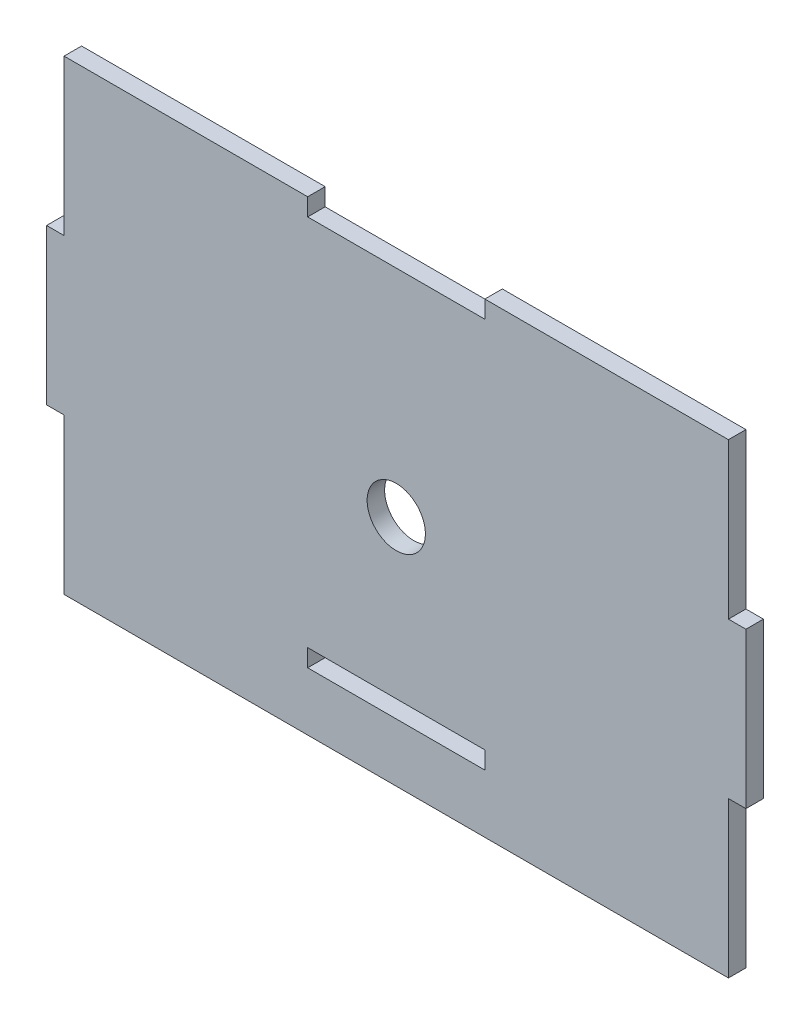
ISO-10303-21;
HEADER;
FILE_DESCRIPTION(('STEP AP214'),'2;1');
FILE_NAME('part.step','',(''),(''),'','','');
FILE_SCHEMA(('AUTOMOTIVE_DESIGN { 1 0 10303 214 1 1 1 1 }'));
ENDSEC;
DATA;
#1=APPLICATION_CONTEXT('core data for automotive mechanical design processes');
#2=APPLICATION_PROTOCOL_DEFINITION('international standard','automotive_design',2000,#1);
#3=PRODUCT_CONTEXT('',#1,'mechanical');
#4=PRODUCT('Part','Part','',(#3));
#5=PRODUCT_RELATED_PRODUCT_CATEGORY('part','',(#4));
#6=PRODUCT_DEFINITION_FORMATION('','',#4);
#7=PRODUCT_DEFINITION_CONTEXT('part definition',#1,'design');
#8=PRODUCT_DEFINITION('design','',#6,#7);
#9=PRODUCT_DEFINITION_SHAPE('','',#8);
#10=(LENGTH_UNIT() NAMED_UNIT(*) SI_UNIT(.MILLI.,.METRE.));
#11=(NAMED_UNIT(*) PLANE_ANGLE_UNIT() SI_UNIT($,.RADIAN.));
#12=(NAMED_UNIT(*) SI_UNIT($,.STERADIAN.) SOLID_ANGLE_UNIT());
#13=UNCERTAINTY_MEASURE_WITH_UNIT(LENGTH_MEASURE(1.E-05),#10,'distance_accuracy_value','');
#14=(GEOMETRIC_REPRESENTATION_CONTEXT(3) GLOBAL_UNCERTAINTY_ASSIGNED_CONTEXT((#13)) GLOBAL_UNIT_ASSIGNED_CONTEXT((#10,
#11,#12)) REPRESENTATION_CONTEXT('',''));
#15=CARTESIAN_POINT('',(0.,0.,0.));
#16=DIRECTION('',(0.,0.,1.));
#17=DIRECTION('',(1.,0.,0.));
#18=AXIS2_PLACEMENT_3D('',#15,#16,#17);
#19=CARTESIAN_POINT('',(0.,0.,3.));
#20=DIRECTION('',(0.,0.,-1.));
#21=DIRECTION('',(-1.,0.,0.));
#22=AXIS2_PLACEMENT_3D('',#19,#20,#21);
#23=PLANE('',#22);
#24=CARTESIAN_POINT('',(0.,0.,3.));
#25=DIRECTION('',(0.,0.,1.));
#26=DIRECTION('',(1.,0.,0.));
#27=AXIS2_PLACEMENT_3D('',#24,#25,#26);
#28=CIRCLE('',#27,5.);
#29=CARTESIAN_POINT('',(5.,0.,3.));
#30=VERTEX_POINT('',#29);
#31=EDGE_CURVE('E640',#30,#30,#28,.T.);
#32=ORIENTED_EDGE('',*,*,#31,.F.);
#33=EDGE_LOOP('',(#32));
#34=FACE_BOUND('',#33,.T.);
#35=DIRECTION('',(0.,-1.,0.));
#36=VECTOR('',#35,1.);
#37=CARTESIAN_POINT('',(15.2,0.,3.));
#38=LINE('',#37,#36);
#39=CARTESIAN_POINT('',(15.2,-27.,3.));
#40=VERTEX_POINT('',#39);
#41=CARTESIAN_POINT('',(15.2,-30.,3.));
#42=VERTEX_POINT('',#41);
#43=EDGE_CURVE('E298',#40,#42,#38,.T.);
#44=ORIENTED_EDGE('',*,*,#43,.T.);
#45=DIRECTION('',(1.,0.,0.));
#46=VECTOR('',#45,1.);
#47=CARTESIAN_POINT('',(0.,-30.,3.));
#48=LINE('',#47,#46);
#49=CARTESIAN_POINT('',(-15.2,-30.,3.));
#50=VERTEX_POINT('',#49);
#51=EDGE_CURVE('E290',#50,#42,#48,.T.);
#52=ORIENTED_EDGE('',*,*,#51,.F.);
#53=DIRECTION('',(0.,-1.,0.));
#54=VECTOR('',#53,1.);
#55=CARTESIAN_POINT('',(-15.2,0.,3.));
#56=LINE('',#55,#54);
#57=CARTESIAN_POINT('',(-15.2,-27.,3.));
#58=VERTEX_POINT('',#57);
#59=EDGE_CURVE('E316',#58,#50,#56,.T.);
#60=ORIENTED_EDGE('',*,*,#59,.F.);
#61=DIRECTION('',(1.,0.,0.));
#62=VECTOR('',#61,1.);
#63=CARTESIAN_POINT('',(0.,-27.,3.));
#64=LINE('',#63,#62);
#65=EDGE_CURVE('E302',#58,#40,#64,.T.);
#66=ORIENTED_EDGE('',*,*,#65,.T.);
#67=EDGE_LOOP('',(#44,#52,#60,#66));
#68=FACE_BOUND('',#67,.T.);
#69=DIRECTION('',(0.,-1.,0.));
#70=VECTOR('',#69,1.);
#71=CARTESIAN_POINT('',(15.2,67.,3.));
#72=LINE('',#71,#70);
#73=CARTESIAN_POINT('',(15.2,40.,3.));
#74=VERTEX_POINT('',#73);
#75=CARTESIAN_POINT('',(15.2,37.,3.));
#76=VERTEX_POINT('',#75);
#77=EDGE_CURVE('E179',#74,#76,#72,.T.);
#78=ORIENTED_EDGE('',*,*,#77,.T.);
#79=DIRECTION('',(1.,0.,0.));
#80=VECTOR('',#79,1.);
#81=CARTESIAN_POINT('',(0.,37.,3.));
#82=LINE('',#81,#80);
#83=CARTESIAN_POINT('',(-15.2,37.,3.));
#84=VERTEX_POINT('',#83);
#85=EDGE_CURVE('E194',#84,#76,#82,.T.);
#86=ORIENTED_EDGE('',*,*,#85,.F.);
#87=DIRECTION('',(0.,-1.,0.));
#88=VECTOR('',#87,1.);
#89=CARTESIAN_POINT('',(-15.2,67.,3.));
#90=LINE('',#89,#88);
#91=CARTESIAN_POINT('',(-15.2,40.,3.));
#92=VERTEX_POINT('',#91);
#93=EDGE_CURVE('E609',#92,#84,#90,.T.);
#94=ORIENTED_EDGE('',*,*,#93,.F.);
#95=DIRECTION('',(-1.,0.,0.));
#96=VECTOR('',#95,1.);
#97=CARTESIAN_POINT('',(-60.,40.,3.));
#98=LINE('',#97,#96);
#99=CARTESIAN_POINT('',(-57.,40.,3.));
#100=VERTEX_POINT('',#99);
#101=EDGE_CURVE('E214',#92,#100,#98,.T.);
#102=ORIENTED_EDGE('',*,*,#101,.T.);
#103=DIRECTION('',(0.,-1.,0.));
#104=VECTOR('',#103,1.);
#105=CARTESIAN_POINT('',(-57.,0.,3.));
#106=LINE('',#105,#104);
#107=CARTESIAN_POINT('',(-57.,13.3333333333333,3.));
#108=VERTEX_POINT('',#107);
#109=EDGE_CURVE('E280',#100,#108,#106,.T.);
#110=ORIENTED_EDGE('',*,*,#109,.T.);
#111=DIRECTION('',(1.,0.,0.));
#112=VECTOR('',#111,1.);
#113=CARTESIAN_POINT('',(0.,13.3333333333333,3.));
#114=LINE('',#113,#112);
#115=CARTESIAN_POINT('',(-60.,13.3333333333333,3.));
#116=VERTEX_POINT('',#115);
#117=EDGE_CURVE('E594',#116,#108,#114,.T.);
#118=ORIENTED_EDGE('',*,*,#117,.F.);
#119=DIRECTION('',(0.,-1.,0.));
#120=VECTOR('',#119,1.);
#121=CARTESIAN_POINT('',(-60.,-40.,3.));
#122=LINE('',#121,#120);
#123=CARTESIAN_POINT('',(-60.,-13.3333333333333,3.));
#124=VERTEX_POINT('',#123);
#125=EDGE_CURVE('E44',#116,#124,#122,.T.);
#126=ORIENTED_EDGE('',*,*,#125,.T.);
#127=DIRECTION('',(1.,0.,0.));
#128=VECTOR('',#127,1.);
#129=CARTESIAN_POINT('',(0.,-13.3333333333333,3.));
#130=LINE('',#129,#128);
#131=CARTESIAN_POINT('',(-57.,-13.3333333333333,3.));
#132=VERTEX_POINT('',#131);
#133=EDGE_CURVE('E271',#124,#132,#130,.T.);
#134=ORIENTED_EDGE('',*,*,#133,.T.);
#135=DIRECTION('',(0.,-1.,0.));
#136=VECTOR('',#135,1.);
#137=CARTESIAN_POINT('',(-57.,0.,3.));
#138=LINE('',#137,#136);
#139=CARTESIAN_POINT('',(-57.,-40.,3.));
#140=VERTEX_POINT('',#139);
#141=EDGE_CURVE('E240',#132,#140,#138,.T.);
#142=ORIENTED_EDGE('',*,*,#141,.T.);
#143=DIRECTION('',(1.,0.,0.));
#144=VECTOR('',#143,1.);
#145=CARTESIAN_POINT('',(-60.,-40.,3.));
#146=LINE('',#145,#144);
#147=CARTESIAN_POINT('',(57.,-40.,3.));
#148=VERTEX_POINT('',#147);
#149=EDGE_CURVE('E12',#140,#148,#146,.T.);
#150=ORIENTED_EDGE('',*,*,#149,.T.);
#151=DIRECTION('',(0.,-1.,0.));
#152=VECTOR('',#151,1.);
#153=CARTESIAN_POINT('',(57.,0.,3.));
#154=LINE('',#153,#152);
#155=CARTESIAN_POINT('',(57.,-13.3333333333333,3.));
#156=VERTEX_POINT('',#155);
#157=EDGE_CURVE('E254',#156,#148,#154,.T.);
#158=ORIENTED_EDGE('',*,*,#157,.F.);
#159=DIRECTION('',(-1.,0.,0.));
#160=VECTOR('',#159,1.);
#161=CARTESIAN_POINT('',(0.,-13.3333333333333,3.));
#162=LINE('',#161,#160);
#163=CARTESIAN_POINT('',(60.,-13.3333333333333,3.));
#164=VERTEX_POINT('',#163);
#165=EDGE_CURVE('E250',#164,#156,#162,.T.);
#166=ORIENTED_EDGE('',*,*,#165,.F.);
#167=DIRECTION('',(0.,1.,0.));
#168=VECTOR('',#167,1.);
#169=CARTESIAN_POINT('',(60.,-40.,3.));
#170=LINE('',#169,#168);
#171=CARTESIAN_POINT('',(60.,13.3333333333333,3.));
#172=VERTEX_POINT('',#171);
#173=EDGE_CURVE('E208',#164,#172,#170,.T.);
#174=ORIENTED_EDGE('',*,*,#173,.T.);
#175=DIRECTION('',(-1.,0.,0.));
#176=VECTOR('',#175,1.);
#177=CARTESIAN_POINT('',(0.,13.3333333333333,3.));
#178=LINE('',#177,#176);
#179=CARTESIAN_POINT('',(57.,13.3333333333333,3.));
#180=VERTEX_POINT('',#179);
#181=EDGE_CURVE('E60',#172,#180,#178,.T.);
#182=ORIENTED_EDGE('',*,*,#181,.T.);
#183=DIRECTION('',(0.,-1.,0.));
#184=VECTOR('',#183,1.);
#185=CARTESIAN_POINT('',(57.,0.,3.));
#186=LINE('',#185,#184);
#187=CARTESIAN_POINT('',(57.,40.,3.));
#188=VERTEX_POINT('',#187);
#189=EDGE_CURVE('E236',#188,#180,#186,.T.);
#190=ORIENTED_EDGE('',*,*,#189,.F.);
#191=EDGE_CURVE('E219',#188,#74,#98,.T.);
#192=ORIENTED_EDGE('',*,*,#191,.T.);
#193=EDGE_LOOP('',(#78,#86,#94,#102,#110,#118,#126,#134,#142,#150,#158,#166,#174,#182,#190,#192));
#194=FACE_BOUND('',#193,.T.);
#195=ADVANCED_FACE('F35',(#34,#68,#194),#23,.F.);
#196=CARTESIAN_POINT('',(0.,0.,0.));
#197=DIRECTION('',(0.,0.,-1.));
#198=DIRECTION('',(-1.,0.,0.));
#199=AXIS2_PLACEMENT_3D('',#196,#197,#198);
#200=PLANE('',#199);
#201=CARTESIAN_POINT('',(0.,0.,0.));
#202=DIRECTION('',(0.,0.,-1.));
#203=DIRECTION('',(-1.,0.,0.));
#204=AXIS2_PLACEMENT_3D('',#201,#202,#203);
#205=CIRCLE('',#204,5.);
#206=CARTESIAN_POINT('',(-5.,0.,0.));
#207=VERTEX_POINT('',#206);
#208=EDGE_CURVE('E39',#207,#207,#205,.T.);
#209=ORIENTED_EDGE('',*,*,#208,.F.);
#210=EDGE_LOOP('',(#209));
#211=FACE_BOUND('',#210,.T.);
#212=DIRECTION('',(1.,0.,0.));
#213=VECTOR('',#212,1.);
#214=CARTESIAN_POINT('',(0.,-30.,0.));
#215=LINE('',#214,#213);
#216=CARTESIAN_POINT('',(-15.2,-30.,0.));
#217=VERTEX_POINT('',#216);
#218=CARTESIAN_POINT('',(15.2,-30.,0.));
#219=VERTEX_POINT('',#218);
#220=EDGE_CURVE('E295',#217,#219,#215,.T.);
#221=ORIENTED_EDGE('',*,*,#220,.T.);
#222=DIRECTION('',(0.,-1.,0.));
#223=VECTOR('',#222,1.);
#224=CARTESIAN_POINT('',(15.2,0.,0.));
#225=LINE('',#224,#223);
#226=CARTESIAN_POINT('',(15.2,-27.,0.));
#227=VERTEX_POINT('',#226);
#228=EDGE_CURVE('E287',#227,#219,#225,.T.);
#229=ORIENTED_EDGE('',*,*,#228,.F.);
#230=DIRECTION('',(1.,0.,0.));
#231=VECTOR('',#230,1.);
#232=CARTESIAN_POINT('',(0.,-27.,0.));
#233=LINE('',#232,#231);
#234=CARTESIAN_POINT('',(-15.2,-27.,0.));
#235=VERTEX_POINT('',#234);
#236=EDGE_CURVE('E289',#235,#227,#233,.T.);
#237=ORIENTED_EDGE('',*,*,#236,.F.);
#238=DIRECTION('',(0.,-1.,0.));
#239=VECTOR('',#238,1.);
#240=CARTESIAN_POINT('',(-15.2,0.,0.));
#241=LINE('',#240,#239);
#242=EDGE_CURVE('E292',#235,#217,#241,.T.);
#243=ORIENTED_EDGE('',*,*,#242,.T.);
#244=EDGE_LOOP('',(#221,#229,#237,#243));
#245=FACE_BOUND('',#244,.T.);
#246=DIRECTION('',(1.,0.,0.));
#247=VECTOR('',#246,1.);
#248=CARTESIAN_POINT('',(0.,37.,0.));
#249=LINE('',#248,#247);
#250=CARTESIAN_POINT('',(-15.2,37.,0.));
#251=VERTEX_POINT('',#250);
#252=CARTESIAN_POINT('',(15.2,37.,0.));
#253=VERTEX_POINT('',#252);
#254=EDGE_CURVE('E185',#251,#253,#249,.T.);
#255=ORIENTED_EDGE('',*,*,#254,.T.);
#256=DIRECTION('',(0.,-1.,0.));
#257=VECTOR('',#256,1.);
#258=CARTESIAN_POINT('',(15.2,67.,0.));
#259=LINE('',#258,#257);
#260=CARTESIAN_POINT('',(15.2,40.,0.));
#261=VERTEX_POINT('',#260);
#262=EDGE_CURVE('E176',#261,#253,#259,.T.);
#263=ORIENTED_EDGE('',*,*,#262,.F.);
#264=DIRECTION('',(-1.,0.,0.));
#265=VECTOR('',#264,1.);
#266=CARTESIAN_POINT('',(-60.,40.,0.));
#267=LINE('',#266,#265);
#268=CARTESIAN_POINT('',(57.,40.,0.));
#269=VERTEX_POINT('',#268);
#270=EDGE_CURVE('E192',#269,#261,#267,.T.);
#271=ORIENTED_EDGE('',*,*,#270,.F.);
#272=DIRECTION('',(0.,-1.,0.));
#273=VECTOR('',#272,1.);
#274=CARTESIAN_POINT('',(57.,0.,0.));
#275=LINE('',#274,#273);
#276=CARTESIAN_POINT('',(57.,13.3333333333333,0.));
#277=VERTEX_POINT('',#276);
#278=EDGE_CURVE('E235',#269,#277,#275,.T.);
#279=ORIENTED_EDGE('',*,*,#278,.T.);
#280=DIRECTION('',(-1.,0.,0.));
#281=VECTOR('',#280,1.);
#282=CARTESIAN_POINT('',(0.,13.3333333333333,0.));
#283=LINE('',#282,#281);
#284=CARTESIAN_POINT('',(60.,13.3333333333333,0.));
#285=VERTEX_POINT('',#284);
#286=EDGE_CURVE('E245',#285,#277,#283,.T.);
#287=ORIENTED_EDGE('',*,*,#286,.F.);
#288=DIRECTION('',(0.,1.,0.));
#289=VECTOR('',#288,1.);
#290=CARTESIAN_POINT('',(60.,-40.,0.));
#291=LINE('',#290,#289);
#292=CARTESIAN_POINT('',(60.,-13.3333333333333,0.));
#293=VERTEX_POINT('',#292);
#294=EDGE_CURVE('E205',#293,#285,#291,.T.);
#295=ORIENTED_EDGE('',*,*,#294,.F.);
#296=DIRECTION('',(-1.,0.,0.));
#297=VECTOR('',#296,1.);
#298=CARTESIAN_POINT('',(0.,-13.3333333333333,0.));
#299=LINE('',#298,#297);
#300=CARTESIAN_POINT('',(57.,-13.3333333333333,0.));
#301=VERTEX_POINT('',#300);
#302=EDGE_CURVE('E249',#293,#301,#299,.T.);
#303=ORIENTED_EDGE('',*,*,#302,.T.);
#304=DIRECTION('',(0.,-1.,0.));
#305=VECTOR('',#304,1.);
#306=CARTESIAN_POINT('',(57.,0.,0.));
#307=LINE('',#306,#305);
#308=CARTESIAN_POINT('',(57.,-40.,0.));
#309=VERTEX_POINT('',#308);
#310=EDGE_CURVE('E246',#301,#309,#307,.T.);
#311=ORIENTED_EDGE('',*,*,#310,.T.);
#312=DIRECTION('',(1.,0.,0.));
#313=VECTOR('',#312,1.);
#314=CARTESIAN_POINT('',(-60.,-40.,0.));
#315=LINE('',#314,#313);
#316=CARTESIAN_POINT('',(-57.,-40.,0.));
#317=VERTEX_POINT('',#316);
#318=EDGE_CURVE('E203',#317,#309,#315,.T.);
#319=ORIENTED_EDGE('',*,*,#318,.F.);
#320=DIRECTION('',(0.,-1.,0.));
#321=VECTOR('',#320,1.);
#322=CARTESIAN_POINT('',(-57.,0.,0.));
#323=LINE('',#322,#321);
#324=CARTESIAN_POINT('',(-57.,-13.3333333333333,0.));
#325=VERTEX_POINT('',#324);
#326=EDGE_CURVE('E275',#325,#317,#323,.T.);
#327=ORIENTED_EDGE('',*,*,#326,.F.);
#328=DIRECTION('',(1.,0.,0.));
#329=VECTOR('',#328,1.);
#330=CARTESIAN_POINT('',(0.,-13.3333333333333,0.));
#331=LINE('',#330,#329);
#332=CARTESIAN_POINT('',(-60.,-13.3333333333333,0.));
#333=VERTEX_POINT('',#332);
#334=EDGE_CURVE('E286',#333,#325,#331,.T.);
#335=ORIENTED_EDGE('',*,*,#334,.F.);
#336=DIRECTION('',(0.,-1.,0.));
#337=VECTOR('',#336,1.);
#338=CARTESIAN_POINT('',(-60.,-40.,0.));
#339=LINE('',#338,#337);
#340=CARTESIAN_POINT('',(-60.,13.3333333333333,0.));
#341=VERTEX_POINT('',#340);
#342=EDGE_CURVE('E199',#341,#333,#339,.T.);
#343=ORIENTED_EDGE('',*,*,#342,.F.);
#344=DIRECTION('',(1.,0.,0.));
#345=VECTOR('',#344,1.);
#346=CARTESIAN_POINT('',(0.,13.3333333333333,0.));
#347=LINE('',#346,#345);
#348=CARTESIAN_POINT('',(-57.,13.3333333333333,0.));
#349=VERTEX_POINT('',#348);
#350=EDGE_CURVE('E587',#341,#349,#347,.T.);
#351=ORIENTED_EDGE('',*,*,#350,.T.);
#352=DIRECTION('',(0.,-1.,0.));
#353=VECTOR('',#352,1.);
#354=CARTESIAN_POINT('',(-57.,0.,0.));
#355=LINE('',#354,#353);
#356=CARTESIAN_POINT('',(-57.,40.,0.));
#357=VERTEX_POINT('',#356);
#358=EDGE_CURVE('E598',#357,#349,#355,.T.);
#359=ORIENTED_EDGE('',*,*,#358,.F.);
#360=CARTESIAN_POINT('',(-15.2,40.,0.));
#361=VERTEX_POINT('',#360);
#362=EDGE_CURVE('E200',#361,#357,#267,.T.);
#363=ORIENTED_EDGE('',*,*,#362,.F.);
#364=DIRECTION('',(0.,-1.,0.));
#365=VECTOR('',#364,1.);
#366=CARTESIAN_POINT('',(-15.2,67.,0.));
#367=LINE('',#366,#365);
#368=EDGE_CURVE('E52',#361,#251,#367,.T.);
#369=ORIENTED_EDGE('',*,*,#368,.T.);
#370=EDGE_LOOP('',(#255,#263,#271,#279,#287,#295,#303,#311,#319,#327,#335,#343,#351,#359,#363,#369));
#371=FACE_BOUND('',#370,.T.);
#372=ADVANCED_FACE('F190',(#211,#245,#371),#200,.T.);
#373=CARTESIAN_POINT('',(-60.,40.,3.));
#374=DIRECTION('',(0.,-1.,0.));
#375=DIRECTION('',(0.,0.,-1.));
#376=AXIS2_PLACEMENT_3D('',#373,#374,#375);
#377=PLANE('',#376);
#378=DIRECTION('',(0.,0.,1.));
#379=VECTOR('',#378,1.);
#380=CARTESIAN_POINT('',(15.2,40.,0.));
#381=LINE('',#380,#379);
#382=EDGE_CURVE('E173',#261,#74,#381,.T.);
#383=ORIENTED_EDGE('',*,*,#382,.T.);
#384=ORIENTED_EDGE('',*,*,#191,.F.);
#385=DIRECTION('',(0.,0.,1.));
#386=VECTOR('',#385,1.);
#387=CARTESIAN_POINT('',(57.,40.,0.));
#388=LINE('',#387,#386);
#389=EDGE_CURVE('E198',#269,#188,#388,.T.);
#390=ORIENTED_EDGE('',*,*,#389,.F.);
#391=ORIENTED_EDGE('',*,*,#270,.T.);
#392=EDGE_LOOP('',(#383,#384,#390,#391));
#393=FACE_BOUND('',#392,.T.);
#394=ADVANCED_FACE('F197',(#393),#377,.F.);
#395=CARTESIAN_POINT('',(60.,-40.,3.));
#396=DIRECTION('',(-1.,0.,0.));
#397=DIRECTION('',(0.,0.,1.));
#398=AXIS2_PLACEMENT_3D('',#395,#396,#397);
#399=PLANE('',#398);
#400=DIRECTION('',(0.,0.,1.));
#401=VECTOR('',#400,1.);
#402=CARTESIAN_POINT('',(60.,13.3333333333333,0.));
#403=LINE('',#402,#401);
#404=EDGE_CURVE('E241',#285,#172,#403,.T.);
#405=ORIENTED_EDGE('',*,*,#404,.T.);
#406=ORIENTED_EDGE('',*,*,#173,.F.);
#407=DIRECTION('',(0.,0.,1.));
#408=VECTOR('',#407,1.);
#409=CARTESIAN_POINT('',(60.,-13.3333333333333,0.));
#410=LINE('',#409,#408);
#411=EDGE_CURVE('E629',#293,#164,#410,.T.);
#412=ORIENTED_EDGE('',*,*,#411,.F.);
#413=ORIENTED_EDGE('',*,*,#294,.T.);
#414=EDGE_LOOP('',(#405,#406,#412,#413));
#415=FACE_BOUND('',#414,.T.);
#416=ADVANCED_FACE('F37',(#415),#399,.F.);
#417=ORIENTED_EDGE('',*,*,#101,.F.);
#418=DIRECTION('',(0.,0.,1.));
#419=VECTOR('',#418,1.);
#420=CARTESIAN_POINT('',(-15.2,40.,0.));
#421=LINE('',#420,#419);
#422=EDGE_CURVE('E184',#361,#92,#421,.T.);
#423=ORIENTED_EDGE('',*,*,#422,.F.);
#424=ORIENTED_EDGE('',*,*,#362,.T.);
#425=DIRECTION('',(0.,0.,1.));
#426=VECTOR('',#425,1.);
#427=CARTESIAN_POINT('',(-57.,40.,0.));
#428=LINE('',#427,#426);
#429=EDGE_CURVE('E590',#357,#100,#428,.T.);
#430=ORIENTED_EDGE('',*,*,#429,.T.);
#431=EDGE_LOOP('',(#417,#423,#424,#430));
#432=FACE_BOUND('',#431,.T.);
#433=ADVANCED_FACE('F366',(#432),#377,.F.);
#434=CARTESIAN_POINT('',(-60.,-40.,3.));
#435=DIRECTION('',(1.,0.,0.));
#436=DIRECTION('',(0.,0.,-1.));
#437=AXIS2_PLACEMENT_3D('',#434,#435,#436);
#438=PLANE('',#437);
#439=ORIENTED_EDGE('',*,*,#125,.F.);
#440=DIRECTION('',(0.,0.,1.));
#441=VECTOR('',#440,1.);
#442=CARTESIAN_POINT('',(-60.,13.3333333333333,0.));
#443=LINE('',#442,#441);
#444=EDGE_CURVE('E584',#341,#116,#443,.T.);
#445=ORIENTED_EDGE('',*,*,#444,.F.);
#446=ORIENTED_EDGE('',*,*,#342,.T.);
#447=DIRECTION('',(0.,0.,1.));
#448=VECTOR('',#447,1.);
#449=CARTESIAN_POINT('',(-60.,-13.3333333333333,0.));
#450=LINE('',#449,#448);
#451=EDGE_CURVE('E281',#333,#124,#450,.T.);
#452=ORIENTED_EDGE('',*,*,#451,.T.);
#453=EDGE_LOOP('',(#439,#445,#446,#452));
#454=FACE_BOUND('',#453,.T.);
#455=ADVANCED_FACE('F352',(#454),#438,.F.);
#456=CARTESIAN_POINT('',(-60.,-40.,3.));
#457=DIRECTION('',(0.,1.,0.));
#458=DIRECTION('',(0.,0.,1.));
#459=AXIS2_PLACEMENT_3D('',#456,#457,#458);
#460=PLANE('',#459);
#461=ORIENTED_EDGE('',*,*,#318,.T.);
#462=DIRECTION('',(0.,0.,1.));
#463=VECTOR('',#462,1.);
#464=CARTESIAN_POINT('',(57.,-40.,0.));
#465=LINE('',#464,#463);
#466=EDGE_CURVE('E253',#309,#148,#465,.T.);
#467=ORIENTED_EDGE('',*,*,#466,.T.);
#468=ORIENTED_EDGE('',*,*,#149,.F.);
#469=DIRECTION('',(0.,0.,1.));
#470=VECTOR('',#469,1.);
#471=CARTESIAN_POINT('',(-57.,-40.,0.));
#472=LINE('',#471,#470);
#473=EDGE_CURVE('E278',#317,#140,#472,.T.);
#474=ORIENTED_EDGE('',*,*,#473,.F.);
#475=EDGE_LOOP('',(#461,#467,#468,#474));
#476=FACE_BOUND('',#475,.T.);
#477=ADVANCED_FACE('F345',(#476),#460,.F.);
#478=CARTESIAN_POINT('',(15.2,0.,0.));
#479=DIRECTION('',(-1.,0.,0.));
#480=DIRECTION('',(0.,-1.,0.));
#481=AXIS2_PLACEMENT_3D('',#478,#479,#480);
#482=PLANE('',#481);
#483=ORIENTED_EDGE('',*,*,#43,.F.);
#484=DIRECTION('',(0.,0.,1.));
#485=VECTOR('',#484,1.);
#486=CARTESIAN_POINT('',(15.2,-27.,0.));
#487=LINE('',#486,#485);
#488=EDGE_CURVE('E222',#227,#40,#487,.T.);
#489=ORIENTED_EDGE('',*,*,#488,.F.);
#490=ORIENTED_EDGE('',*,*,#228,.T.);
#491=DIRECTION('',(0.,0.,1.));
#492=VECTOR('',#491,1.);
#493=CARTESIAN_POINT('',(15.2,-30.,0.));
#494=LINE('',#493,#492);
#495=EDGE_CURVE('E318',#219,#42,#494,.T.);
#496=ORIENTED_EDGE('',*,*,#495,.T.);
#497=EDGE_LOOP('',(#483,#489,#490,#496));
#498=FACE_BOUND('',#497,.T.);
#499=ADVANCED_FACE('F343',(#498),#482,.T.);
#500=CARTESIAN_POINT('',(0.,-30.,0.));
#501=DIRECTION('',(0.,-1.,0.));
#502=DIRECTION('',(1.,0.,0.));
#503=AXIS2_PLACEMENT_3D('',#500,#501,#502);
#504=PLANE('',#503);
#505=ORIENTED_EDGE('',*,*,#51,.T.);
#506=ORIENTED_EDGE('',*,*,#495,.F.);
#507=ORIENTED_EDGE('',*,*,#220,.F.);
#508=DIRECTION('',(0.,0.,1.));
#509=VECTOR('',#508,1.);
#510=CARTESIAN_POINT('',(-15.2,-30.,0.));
#511=LINE('',#510,#509);
#512=EDGE_CURVE('E320',#217,#50,#511,.T.);
#513=ORIENTED_EDGE('',*,*,#512,.T.);
#514=EDGE_LOOP('',(#505,#506,#507,#513));
#515=FACE_BOUND('',#514,.T.);
#516=ADVANCED_FACE('F341',(#515),#504,.F.);
#517=CARTESIAN_POINT('',(-15.2,0.,0.));
#518=DIRECTION('',(-1.,0.,0.));
#519=DIRECTION('',(0.,-1.,0.));
#520=AXIS2_PLACEMENT_3D('',#517,#518,#519);
#521=PLANE('',#520);
#522=ORIENTED_EDGE('',*,*,#59,.T.);
#523=ORIENTED_EDGE('',*,*,#512,.F.);
#524=ORIENTED_EDGE('',*,*,#242,.F.);
#525=DIRECTION('',(0.,0.,1.));
#526=VECTOR('',#525,1.);
#527=CARTESIAN_POINT('',(-15.2,-27.,0.));
#528=LINE('',#527,#526);
#529=EDGE_CURVE('E321',#235,#58,#528,.T.);
#530=ORIENTED_EDGE('',*,*,#529,.T.);
#531=EDGE_LOOP('',(#522,#523,#524,#530));
#532=FACE_BOUND('',#531,.T.);
#533=ADVANCED_FACE('F337',(#532),#521,.F.);
#534=CARTESIAN_POINT('',(0.,-27.,0.));
#535=DIRECTION('',(0.,-1.,0.));
#536=DIRECTION('',(0.,0.,-1.));
#537=AXIS2_PLACEMENT_3D('',#534,#535,#536);
#538=PLANE('',#537);
#539=ORIENTED_EDGE('',*,*,#65,.F.);
#540=ORIENTED_EDGE('',*,*,#529,.F.);
#541=ORIENTED_EDGE('',*,*,#236,.T.);
#542=ORIENTED_EDGE('',*,*,#488,.T.);
#543=EDGE_LOOP('',(#539,#540,#541,#542));
#544=FACE_BOUND('',#543,.T.);
#545=ADVANCED_FACE('F330',(#544),#538,.T.);
#546=CARTESIAN_POINT('',(-57.,0.,0.));
#547=DIRECTION('',(-1.,0.,0.));
#548=DIRECTION('',(0.,0.,1.));
#549=AXIS2_PLACEMENT_3D('',#546,#547,#548);
#550=PLANE('',#549);
#551=ORIENTED_EDGE('',*,*,#141,.F.);
#552=DIRECTION('',(0.,0.,1.));
#553=VECTOR('',#552,1.);
#554=CARTESIAN_POINT('',(-57.,-13.3333333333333,0.));
#555=LINE('',#554,#553);
#556=EDGE_CURVE('E284',#325,#132,#555,.T.);
#557=ORIENTED_EDGE('',*,*,#556,.F.);
#558=ORIENTED_EDGE('',*,*,#326,.T.);
#559=ORIENTED_EDGE('',*,*,#473,.T.);
#560=EDGE_LOOP('',(#551,#557,#558,#559));
#561=FACE_BOUND('',#560,.T.);
#562=ADVANCED_FACE('F505',(#561),#550,.T.);
#563=CARTESIAN_POINT('',(0.,-13.3333333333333,0.));
#564=DIRECTION('',(0.,-1.,0.));
#565=DIRECTION('',(0.,0.,-1.));
#566=AXIS2_PLACEMENT_3D('',#563,#564,#565);
#567=PLANE('',#566);
#568=ORIENTED_EDGE('',*,*,#133,.F.);
#569=ORIENTED_EDGE('',*,*,#451,.F.);
#570=ORIENTED_EDGE('',*,*,#334,.T.);
#571=ORIENTED_EDGE('',*,*,#556,.T.);
#572=EDGE_LOOP('',(#568,#569,#570,#571));
#573=FACE_BOUND('',#572,.T.);
#574=ADVANCED_FACE('F501',(#573),#567,.T.);
#575=CARTESIAN_POINT('',(-57.,0.,0.));
#576=DIRECTION('',(-1.,0.,0.));
#577=DIRECTION('',(0.,0.,1.));
#578=AXIS2_PLACEMENT_3D('',#575,#576,#577);
#579=PLANE('',#578);
#580=ORIENTED_EDGE('',*,*,#109,.F.);
#581=ORIENTED_EDGE('',*,*,#429,.F.);
#582=ORIENTED_EDGE('',*,*,#358,.T.);
#583=DIRECTION('',(0.,0.,1.));
#584=VECTOR('',#583,1.);
#585=CARTESIAN_POINT('',(-57.,13.3333333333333,0.));
#586=LINE('',#585,#584);
#587=EDGE_CURVE('E303',#349,#108,#586,.T.);
#588=ORIENTED_EDGE('',*,*,#587,.T.);
#589=EDGE_LOOP('',(#580,#581,#582,#588));
#590=FACE_BOUND('',#589,.T.);
#591=ADVANCED_FACE('F497',(#590),#579,.T.);
#592=CARTESIAN_POINT('',(0.,13.3333333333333,0.));
#593=DIRECTION('',(0.,-1.,0.));
#594=DIRECTION('',(0.,0.,-1.));
#595=AXIS2_PLACEMENT_3D('',#592,#593,#594);
#596=PLANE('',#595);
#597=ORIENTED_EDGE('',*,*,#117,.T.);
#598=ORIENTED_EDGE('',*,*,#587,.F.);
#599=ORIENTED_EDGE('',*,*,#350,.F.);
#600=ORIENTED_EDGE('',*,*,#444,.T.);
#601=EDGE_LOOP('',(#597,#598,#599,#600));
#602=FACE_BOUND('',#601,.T.);
#603=ADVANCED_FACE('F393',(#602),#596,.F.);
#604=CARTESIAN_POINT('',(57.,0.,0.));
#605=DIRECTION('',(-1.,0.,0.));
#606=DIRECTION('',(0.,0.,1.));
#607=AXIS2_PLACEMENT_3D('',#604,#605,#606);
#608=PLANE('',#607);
#609=ORIENTED_EDGE('',*,*,#157,.T.);
#610=ORIENTED_EDGE('',*,*,#466,.F.);
#611=ORIENTED_EDGE('',*,*,#310,.F.);
#612=DIRECTION('',(0.,0.,1.));
#613=VECTOR('',#612,1.);
#614=CARTESIAN_POINT('',(57.,-13.3333333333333,0.));
#615=LINE('',#614,#613);
#616=EDGE_CURVE('E628',#301,#156,#615,.T.);
#617=ORIENTED_EDGE('',*,*,#616,.T.);
#618=EDGE_LOOP('',(#609,#610,#611,#617));
#619=FACE_BOUND('',#618,.T.);
#620=ADVANCED_FACE('F405',(#619),#608,.F.);
#621=CARTESIAN_POINT('',(0.,-13.3333333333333,0.));
#622=DIRECTION('',(0.,1.,0.));
#623=DIRECTION('',(0.,0.,1.));
#624=AXIS2_PLACEMENT_3D('',#621,#622,#623);
#625=PLANE('',#624);
#626=ORIENTED_EDGE('',*,*,#165,.T.);
#627=ORIENTED_EDGE('',*,*,#616,.F.);
#628=ORIENTED_EDGE('',*,*,#302,.F.);
#629=ORIENTED_EDGE('',*,*,#411,.T.);
#630=EDGE_LOOP('',(#626,#627,#628,#629));
#631=FACE_BOUND('',#630,.T.);
#632=ADVANCED_FACE('F409',(#631),#625,.F.);
#633=CARTESIAN_POINT('',(57.,0.,0.));
#634=DIRECTION('',(-1.,0.,0.));
#635=DIRECTION('',(0.,0.,1.));
#636=AXIS2_PLACEMENT_3D('',#633,#634,#635);
#637=PLANE('',#636);
#638=ORIENTED_EDGE('',*,*,#189,.T.);
#639=DIRECTION('',(0.,0.,1.));
#640=VECTOR('',#639,1.);
#641=CARTESIAN_POINT('',(57.,13.3333333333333,0.));
#642=LINE('',#641,#640);
#643=EDGE_CURVE('E243',#277,#180,#642,.T.);
#644=ORIENTED_EDGE('',*,*,#643,.F.);
#645=ORIENTED_EDGE('',*,*,#278,.F.);
#646=ORIENTED_EDGE('',*,*,#389,.T.);
#647=EDGE_LOOP('',(#638,#644,#645,#646));
#648=FACE_BOUND('',#647,.T.);
#649=ADVANCED_FACE('F420',(#648),#637,.F.);
#650=CARTESIAN_POINT('',(0.,13.3333333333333,0.));
#651=DIRECTION('',(0.,1.,0.));
#652=DIRECTION('',(0.,0.,1.));
#653=AXIS2_PLACEMENT_3D('',#650,#651,#652);
#654=PLANE('',#653);
#655=ORIENTED_EDGE('',*,*,#181,.F.);
#656=ORIENTED_EDGE('',*,*,#404,.F.);
#657=ORIENTED_EDGE('',*,*,#286,.T.);
#658=ORIENTED_EDGE('',*,*,#643,.T.);
#659=EDGE_LOOP('',(#655,#656,#657,#658));
#660=FACE_BOUND('',#659,.T.);
#661=ADVANCED_FACE('F429',(#660),#654,.T.);
#662=CARTESIAN_POINT('',(15.2,67.,0.));
#663=DIRECTION('',(-1.,0.,0.));
#664=DIRECTION('',(0.,-1.,0.));
#665=AXIS2_PLACEMENT_3D('',#662,#663,#664);
#666=PLANE('',#665);
#667=ORIENTED_EDGE('',*,*,#77,.F.);
#668=ORIENTED_EDGE('',*,*,#382,.F.);
#669=ORIENTED_EDGE('',*,*,#262,.T.);
#670=DIRECTION('',(0.,0.,1.));
#671=VECTOR('',#670,1.);
#672=CARTESIAN_POINT('',(15.2,37.,0.));
#673=LINE('',#672,#671);
#674=EDGE_CURVE('E256',#253,#76,#673,.T.);
#675=ORIENTED_EDGE('',*,*,#674,.T.);
#676=EDGE_LOOP('',(#667,#668,#669,#675));
#677=FACE_BOUND('',#676,.T.);
#678=ADVANCED_FACE('F175',(#677),#666,.T.);
#679=CARTESIAN_POINT('',(0.,37.,0.));
#680=DIRECTION('',(0.,-1.,0.));
#681=DIRECTION('',(1.,0.,0.));
#682=AXIS2_PLACEMENT_3D('',#679,#680,#681);
#683=PLANE('',#682);
#684=ORIENTED_EDGE('',*,*,#85,.T.);
#685=ORIENTED_EDGE('',*,*,#674,.F.);
#686=ORIENTED_EDGE('',*,*,#254,.F.);
#687=DIRECTION('',(0.,0.,1.));
#688=VECTOR('',#687,1.);
#689=CARTESIAN_POINT('',(-15.2,37.,0.));
#690=LINE('',#689,#688);
#691=EDGE_CURVE('E619',#251,#84,#690,.T.);
#692=ORIENTED_EDGE('',*,*,#691,.T.);
#693=EDGE_LOOP('',(#684,#685,#686,#692));
#694=FACE_BOUND('',#693,.T.);
#695=ADVANCED_FACE('F447',(#694),#683,.F.);
#696=CARTESIAN_POINT('',(-15.2,67.,0.));
#697=DIRECTION('',(-1.,0.,0.));
#698=DIRECTION('',(0.,-1.,0.));
#699=AXIS2_PLACEMENT_3D('',#696,#697,#698);
#700=PLANE('',#699);
#701=ORIENTED_EDGE('',*,*,#93,.T.);
#702=ORIENTED_EDGE('',*,*,#691,.F.);
#703=ORIENTED_EDGE('',*,*,#368,.F.);
#704=ORIENTED_EDGE('',*,*,#422,.T.);
#705=EDGE_LOOP('',(#701,#702,#703,#704));
#706=FACE_BOUND('',#705,.T.);
#707=ADVANCED_FACE('F454',(#706),#700,.F.);
#708=CARTESIAN_POINT('',(0.,0.,-7.));
#709=DIRECTION('',(0.,0.,1.));
#710=DIRECTION('',(1.,0.,0.));
#711=AXIS2_PLACEMENT_3D('',#708,#709,#710);
#712=CYLINDRICAL_SURFACE('',#711,5.);
#713=ORIENTED_EDGE('',*,*,#208,.T.);
#714=EDGE_LOOP('',(#713));
#715=FACE_BOUND('',#714,.T.);
#716=ORIENTED_EDGE('',*,*,#31,.T.);
#717=EDGE_LOOP('',(#716));
#718=FACE_BOUND('',#717,.T.);
#719=ADVANCED_FACE('F462',(#715,#718),#712,.F.);
#720=CLOSED_SHELL('',(#195,#372,#394,#416,#433,#455,#477,#499,#516,#533,#545,#562,#574,#591,
#603,#620,#632,#649,#661,#678,#695,#707,#719));
#721=MANIFOLD_SOLID_BREP('B2',#720);
#722=ADVANCED_BREP_SHAPE_REPRESENTATION('',(#18,#721),#14);
#723=SHAPE_DEFINITION_REPRESENTATION(#9,#722);
ENDSEC;
END-ISO-10303-21;
